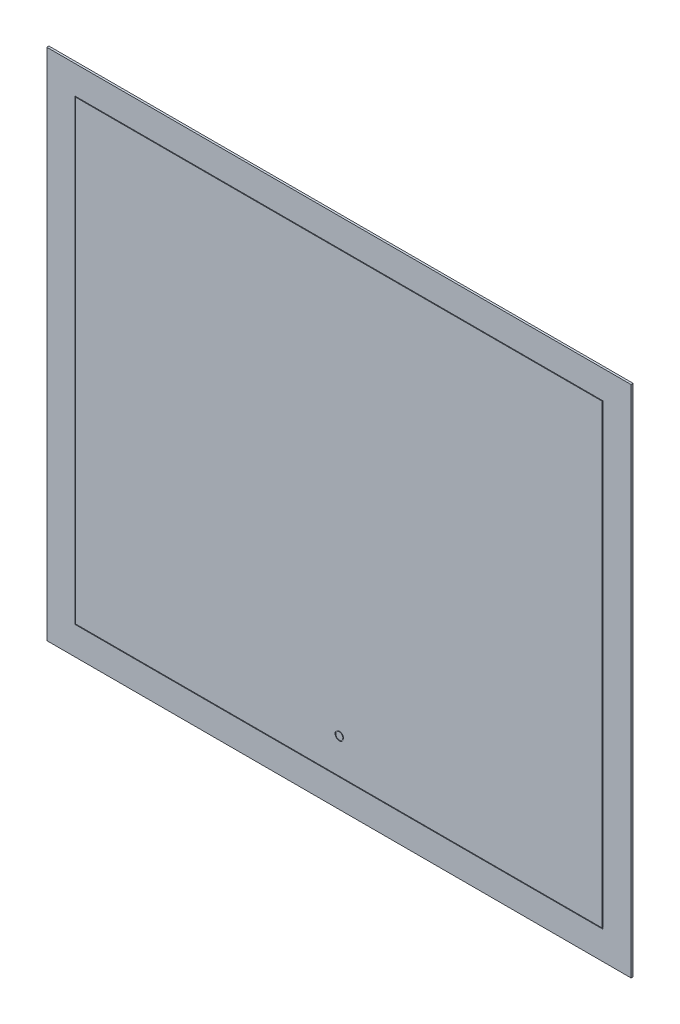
from build123d import *

# Parameters (mm, degrees)
CROQUIS3_W              = 830
CROQUIS3_H              = 730
CROQUIS3_W_2            = 750
CROQUIS3_H_2            = 650
CROQUIS3_W_3            = 748
CROQUIS3_H_3            = 648
SALIENTE_EXTRUIR1_DEPTH = 3
CROQUIS5_W              = 750
CROQUIS5_H              = 650
CROQUIS5_W_2            = 748
CROQUIS5_H_2            = 648
CORTAR_EXTRUIR1_DEPTH   = 1
CROQUIS6_W              = 760
CROQUIS6_H              = 660
SALIENTE_EXTRUIR2_DEPTH = 30
CROQUIS7_W              = 758
CROQUIS7_H              = 658
CORTAR_EXTRUIR2_DEPTH   = 30
CROQUIS8_R              = 6
CROQUIS8_R_2            = 5
CORTAR_EXTRUIR3_DEPTH   = 1


with BuildPart() as part:
    # Croquis3 → Saliente-Extruir1 (new body)
    # profile 1 of 3: a face of its own
    with BuildSketch(Plane.XY):
        with Locations((415, 365)):
            Rectangle(CROQUIS3_W, CROQUIS3_H)
        with Locations((415, 365)):
            Rectangle(CROQUIS3_W_2, CROQUIS3_H_2, mode=Mode.SUBTRACT)
    # profile 2 of 3: a face of its own
    with BuildSketch(Plane.XY):
        with Locations((415, 365)):
            Rectangle(CROQUIS3_W_2, CROQUIS3_H_2)
        with Locations((415, 365)):
            Rectangle(CROQUIS3_W_3, CROQUIS3_H_3, mode=Mode.SUBTRACT)
    # profile 3 of 3: a face of its own
    with BuildSketch(Plane.XY):
        with Locations((415, 365)):
            Rectangle(CROQUIS3_W_3, CROQUIS3_H_3)
    extrude(amount=SALIENTE_EXTRUIR1_DEPTH)

    # Croquis5 → Cortar-Extruir1 (cut)
    with BuildSketch(Plane.XY.offset(3)):
        with Locations((415, 365)):
            Rectangle(CROQUIS5_W, CROQUIS5_H)
        with Locations((415, 365)):
            Rectangle(CROQUIS5_W_2, CROQUIS5_H_2, mode=Mode.SUBTRACT)
    extrude(amount=-CORTAR_EXTRUIR1_DEPTH, mode=Mode.SUBTRACT)

    # Croquis6 → Saliente-Extruir2 (add)
    with BuildSketch(Plane(origin=(0, 0, 0), x_dir=(-1, 0, 0), z_dir=(0, 0, -1))):
        with Locations((-415, 365)):
            Rectangle(CROQUIS6_W, CROQUIS6_H)
    extrude(amount=SALIENTE_EXTRUIR2_DEPTH)

    # Croquis7 → Cortar-Extruir2 (cut)
    with BuildSketch(Plane(origin=(0, 0, -30), x_dir=(-1, 0, 0), z_dir=(0, 0, -1))):
        with Locations((-415, 365)):
            Rectangle(CROQUIS7_W, CROQUIS7_H)
    extrude(amount=-CORTAR_EXTRUIR2_DEPTH, mode=Mode.SUBTRACT)

    # Croquis8 → Cortar-Extruir3 (cut)
    with BuildSketch(Plane.XY.offset(3)):
        with Locations((415.5, 90.5)):
            Circle(CROQUIS8_R)
        with Locations((415.5, 90.5)):
            Circle(CROQUIS8_R_2, mode=Mode.SUBTRACT)
    extrude(amount=-CORTAR_EXTRUIR3_DEPTH, mode=Mode.SUBTRACT)


solid = part.part
